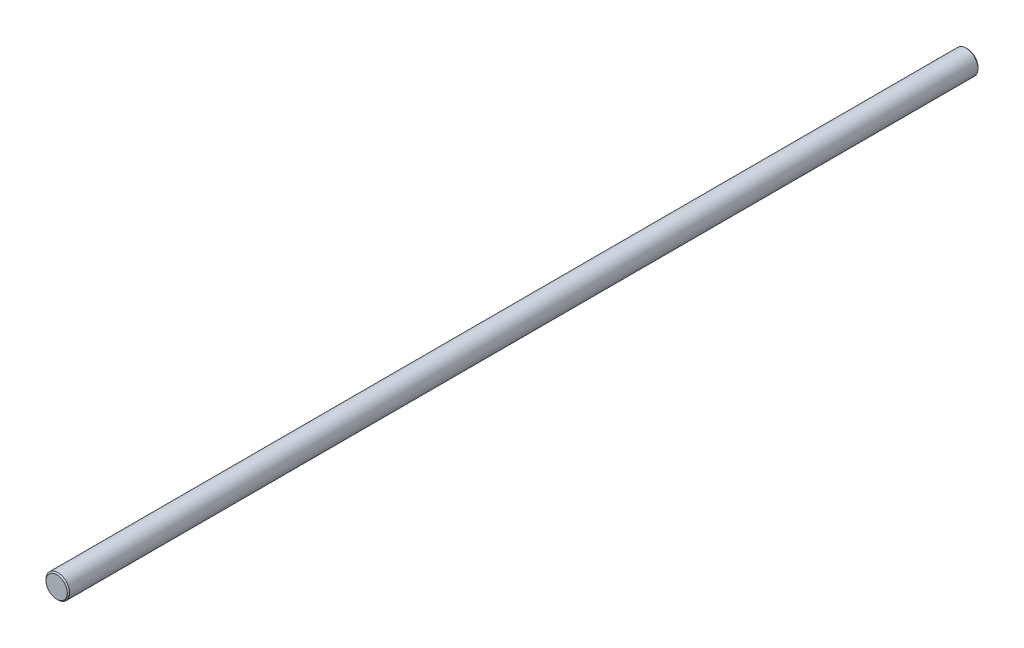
from build123d import *

# Parameters (mm, degrees)
ESQUISSE1_R      = 10
EXTRUSION1_DEPTH = 770
CHANFREIN1_SIZE  = 1


with BuildPart() as part:
    # Esquisse1 → Extrusion1 (new body)
    with BuildSketch(Plane.XY):
        Circle(ESQUISSE1_R)
    extrude(amount=EXTRUSION1_DEPTH)

    # Chanfrein1
    chanfrein1_edges = [part.edges().sort_by_distance(p)[0] for p in [
        (-10, 0, 0),
        (-10, 0, 770),
    ]]
    chamfer(chanfrein1_edges, length=CHANFREIN1_SIZE)


solid = part.part
